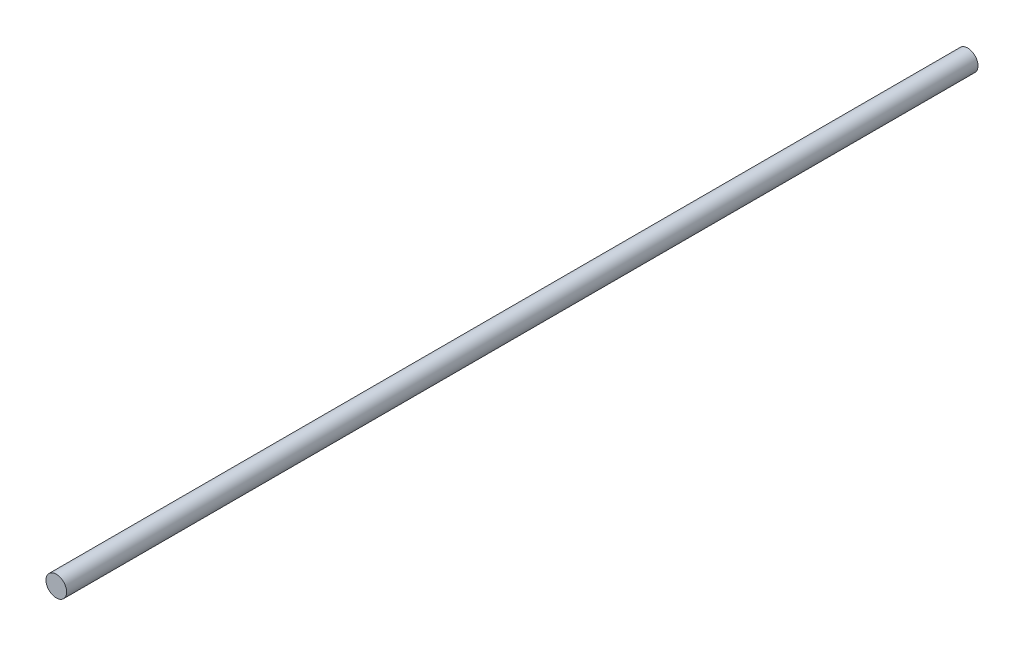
from build123d import *

# Parameters (mm, degrees)
SKETCH1_R           = 30
BOSS_EXTRUDE1_DEPTH = 2650


with BuildPart() as part:
    # Sketch1 → Boss-Extrude1 (new body)
    with BuildSketch(Plane.XY):
        Circle(SKETCH1_R)
    extrude(amount=-BOSS_EXTRUDE1_DEPTH)


solid = part.part
